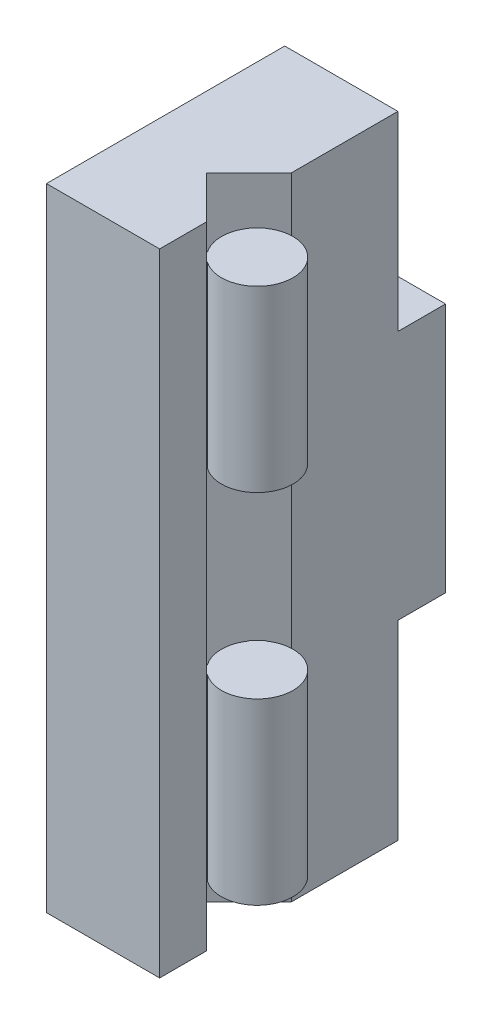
ISO-10303-21;
HEADER;
FILE_DESCRIPTION(('STEP AP214'),'2;1');
FILE_NAME('part.step','',(''),(''),'','','');
FILE_SCHEMA(('AUTOMOTIVE_DESIGN { 1 0 10303 214 1 1 1 1 }'));
ENDSEC;
DATA;
#1=APPLICATION_CONTEXT('core data for automotive mechanical design processes');
#2=APPLICATION_PROTOCOL_DEFINITION('international standard','automotive_design',2000,#1);
#3=PRODUCT_CONTEXT('',#1,'mechanical');
#4=PRODUCT('Part','Part','',(#3));
#5=PRODUCT_RELATED_PRODUCT_CATEGORY('part','',(#4));
#6=PRODUCT_DEFINITION_FORMATION('','',#4);
#7=PRODUCT_DEFINITION_CONTEXT('part definition',#1,'design');
#8=PRODUCT_DEFINITION('design','',#6,#7);
#9=PRODUCT_DEFINITION_SHAPE('','',#8);
#10=(LENGTH_UNIT() NAMED_UNIT(*) SI_UNIT(.MILLI.,.METRE.));
#11=(NAMED_UNIT(*) PLANE_ANGLE_UNIT() SI_UNIT($,.RADIAN.));
#12=(NAMED_UNIT(*) SI_UNIT($,.STERADIAN.) SOLID_ANGLE_UNIT());
#13=UNCERTAINTY_MEASURE_WITH_UNIT(LENGTH_MEASURE(1.E-05),#10,'distance_accuracy_value','');
#14=(GEOMETRIC_REPRESENTATION_CONTEXT(3) GLOBAL_UNCERTAINTY_ASSIGNED_CONTEXT((#13)) GLOBAL_UNIT_ASSIGNED_CONTEXT((#10,
#11,#12)) REPRESENTATION_CONTEXT('',''));
#15=CARTESIAN_POINT('',(0.,0.,0.));
#16=DIRECTION('',(0.,0.,1.));
#17=DIRECTION('',(1.,0.,0.));
#18=AXIS2_PLACEMENT_3D('',#15,#16,#17);
#19=CARTESIAN_POINT('',(18.7801622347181,-59.6376493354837,21.9806672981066));
#20=DIRECTION('',(0.707106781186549,0.,-0.707106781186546));
#21=DIRECTION('',(-0.707106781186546,0.,-0.70710678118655));
#22=AXIS2_PLACEMENT_3D('',#19,#20,#21);
#23=PLANE('',#22);
#24=DIRECTION('',(0.,-1.,0.));
#25=VECTOR('',#24,1.);
#26=CARTESIAN_POINT('',(16.8497474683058,53.,20.0502525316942));
#27=LINE('',#26,#25);
#28=CARTESIAN_POINT('',(16.8497474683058,-15.,20.0502525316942));
#29=VERTEX_POINT('',#28);
#30=CARTESIAN_POINT('',(16.8497474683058,-45.,20.0502525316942));
#31=VERTEX_POINT('',#30);
#32=EDGE_CURVE('E245',#29,#31,#27,.T.);
#33=ORIENTED_EDGE('',*,*,#32,.F.);
#34=DIRECTION('',(0.707106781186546,0.,0.70710678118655));
#35=VECTOR('',#34,1.);
#36=CARTESIAN_POINT('',(18.7801622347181,-15.,21.9806672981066));
#37=LINE('',#36,#35);
#38=CARTESIAN_POINT('',(16.9090880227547,-15.,20.1095930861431));
#39=VERTEX_POINT('',#38);
#40=EDGE_CURVE('E573',#29,#39,#37,.T.);
#41=ORIENTED_EDGE('',*,*,#40,.T.);
#42=DIRECTION('',(0.,-1.,0.));
#43=VECTOR('',#42,1.);
#44=CARTESIAN_POINT('',(16.9090880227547,45.,20.1095930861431));
#45=LINE('',#44,#43);
#46=CARTESIAN_POINT('',(16.9090880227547,-45.,20.1095930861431));
#47=VERTEX_POINT('',#46);
#48=EDGE_CURVE('E519',#39,#47,#45,.T.);
#49=ORIENTED_EDGE('',*,*,#48,.T.);
#50=DIRECTION('',(0.707106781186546,0.,0.70710678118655));
#51=VECTOR('',#50,1.);
#52=CARTESIAN_POINT('',(18.7801622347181,-45.,21.9806672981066));
#53=LINE('',#52,#51);
#54=EDGE_CURVE('E546',#31,#47,#53,.T.);
#55=ORIENTED_EDGE('',*,*,#54,.F.);
#56=EDGE_LOOP('',(#33,#41,#49,#55));
#57=FACE_BOUND('',#56,.T.);
#58=ADVANCED_FACE('F14',(#57),#23,.T.);
#59=CARTESIAN_POINT('',(17.365948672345,-59.6376493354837,23.3948808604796));
#60=DIRECTION('',(-0.707106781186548,0.,0.707106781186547));
#61=DIRECTION('',(0.707106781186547,0.,0.707106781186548));
#62=AXIS2_PLACEMENT_3D('',#59,#60,#61);
#63=PLANE('',#62);
#64=DIRECTION('',(0.,-1.,0.));
#65=VECTOR('',#64,1.);
#66=CARTESIAN_POINT('',(15.4948744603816,45.,21.5238066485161));
#67=LINE('',#66,#65);
#68=CARTESIAN_POINT('',(15.4948744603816,-45.,21.5238066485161));
#69=VERTEX_POINT('',#68);
#70=CARTESIAN_POINT('',(15.4948744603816,-15.,21.5238066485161));
#71=VERTEX_POINT('',#70);
#72=EDGE_CURVE('E516',#69,#71,#67,.F.);
#73=ORIENTED_EDGE('',*,*,#72,.T.);
#74=DIRECTION('',(-0.707106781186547,0.,-0.707106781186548));
#75=VECTOR('',#74,1.);
#76=CARTESIAN_POINT('',(17.365948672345,-15.,23.3948808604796));
#77=LINE('',#76,#75);
#78=CARTESIAN_POINT('',(15.4355339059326,-15.,21.4644660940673));
#79=VERTEX_POINT('',#78);
#80=EDGE_CURVE('E237',#71,#79,#77,.T.);
#81=ORIENTED_EDGE('',*,*,#80,.T.);
#82=DIRECTION('',(0.,1.,0.));
#83=VECTOR('',#82,1.);
#84=CARTESIAN_POINT('',(15.4355339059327,53.,21.4644660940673));
#85=LINE('',#84,#83);
#86=CARTESIAN_POINT('',(15.4355339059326,-45.,21.4644660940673));
#87=VERTEX_POINT('',#86);
#88=EDGE_CURVE('E249',#87,#79,#85,.T.);
#89=ORIENTED_EDGE('',*,*,#88,.F.);
#90=DIRECTION('',(-0.707106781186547,0.,-0.707106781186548));
#91=VECTOR('',#90,1.);
#92=CARTESIAN_POINT('',(17.365948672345,-45.,23.3948808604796));
#93=LINE('',#92,#91);
#94=EDGE_CURVE('E542',#69,#87,#93,.T.);
#95=ORIENTED_EDGE('',*,*,#94,.F.);
#96=EDGE_LOOP('',(#73,#81,#89,#95));
#97=FACE_BOUND('',#96,.T.);
#98=ADVANCED_FACE('F441',(#97),#63,.T.);
#99=CARTESIAN_POINT('',(17.365948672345,-59.6376493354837,26.6051191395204));
#100=DIRECTION('',(-0.707106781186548,0.,-0.707106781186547));
#101=DIRECTION('',(-0.707106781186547,0.,0.707106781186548));
#102=AXIS2_PLACEMENT_3D('',#99,#100,#101);
#103=PLANE('',#102);
#104=DIRECTION('',(0.,-1.,0.));
#105=VECTOR('',#104,1.);
#106=CARTESIAN_POINT('',(15.4355339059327,53.,28.5355339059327));
#107=LINE('',#106,#105);
#108=CARTESIAN_POINT('',(15.4355339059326,-15.,28.5355339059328));
#109=VERTEX_POINT('',#108);
#110=CARTESIAN_POINT('',(15.4355339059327,-45.,28.5355339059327));
#111=VERTEX_POINT('',#110);
#112=EDGE_CURVE('E524',#109,#111,#107,.T.);
#113=ORIENTED_EDGE('',*,*,#112,.F.);
#114=DIRECTION('',(0.707106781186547,0.,-0.707106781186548));
#115=VECTOR('',#114,1.);
#116=CARTESIAN_POINT('',(17.365948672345,-15.,26.6051191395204));
#117=LINE('',#116,#115);
#118=CARTESIAN_POINT('',(15.4948744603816,-15.,28.4761933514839));
#119=VERTEX_POINT('',#118);
#120=EDGE_CURVE('E571',#109,#119,#117,.T.);
#121=ORIENTED_EDGE('',*,*,#120,.T.);
#122=DIRECTION('',(0.,-1.,0.));
#123=VECTOR('',#122,1.);
#124=CARTESIAN_POINT('',(15.4948744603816,45.,28.4761933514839));
#125=LINE('',#124,#123);
#126=CARTESIAN_POINT('',(15.4948744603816,-45.,28.4761933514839));
#127=VERTEX_POINT('',#126);
#128=EDGE_CURVE('E513',#119,#127,#125,.T.);
#129=ORIENTED_EDGE('',*,*,#128,.T.);
#130=DIRECTION('',(0.707106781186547,0.,-0.707106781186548));
#131=VECTOR('',#130,1.);
#132=CARTESIAN_POINT('',(17.365948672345,-45.,26.6051191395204));
#133=LINE('',#132,#131);
#134=EDGE_CURVE('E539',#111,#127,#133,.T.);
#135=ORIENTED_EDGE('',*,*,#134,.F.);
#136=EDGE_LOOP('',(#113,#121,#129,#135));
#137=FACE_BOUND('',#136,.T.);
#138=ADVANCED_FACE('F447',(#137),#103,.T.);
#139=CARTESIAN_POINT('',(18.7801622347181,-59.6376493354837,28.0193327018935));
#140=DIRECTION('',(0.707106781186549,0.,0.707106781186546));
#141=DIRECTION('',(0.707106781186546,0.,-0.70710678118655));
#142=AXIS2_PLACEMENT_3D('',#139,#140,#141);
#143=PLANE('',#142);
#144=DIRECTION('',(0.,-1.,0.));
#145=VECTOR('',#144,1.);
#146=CARTESIAN_POINT('',(16.9090880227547,45.,29.8904069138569));
#147=LINE('',#146,#145);
#148=CARTESIAN_POINT('',(16.9090880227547,-45.,29.8904069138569));
#149=VERTEX_POINT('',#148);
#150=CARTESIAN_POINT('',(16.9090880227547,-15.,29.8904069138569));
#151=VERTEX_POINT('',#150);
#152=EDGE_CURVE('E22',#149,#151,#147,.F.);
#153=ORIENTED_EDGE('',*,*,#152,.T.);
#154=DIRECTION('',(-0.707106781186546,0.,0.70710678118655));
#155=VECTOR('',#154,1.);
#156=CARTESIAN_POINT('',(18.7801622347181,-15.,28.0193327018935));
#157=LINE('',#156,#155);
#158=CARTESIAN_POINT('',(16.8497474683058,-15.,29.9497474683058));
#159=VERTEX_POINT('',#158);
#160=EDGE_CURVE('E574',#151,#159,#157,.T.);
#161=ORIENTED_EDGE('',*,*,#160,.T.);
#162=DIRECTION('',(0.,1.,0.));
#163=VECTOR('',#162,1.);
#164=CARTESIAN_POINT('',(16.8497474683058,53.,29.9497474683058));
#165=LINE('',#164,#163);
#166=CARTESIAN_POINT('',(16.8497474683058,-45.,29.9497474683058));
#167=VERTEX_POINT('',#166);
#168=EDGE_CURVE('E522',#167,#159,#165,.T.);
#169=ORIENTED_EDGE('',*,*,#168,.F.);
#170=DIRECTION('',(-0.707106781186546,0.,0.70710678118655));
#171=VECTOR('',#170,1.);
#172=CARTESIAN_POINT('',(18.7801622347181,-45.,28.0193327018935));
#173=LINE('',#172,#171);
#174=EDGE_CURVE('E541',#149,#167,#173,.T.);
#175=ORIENTED_EDGE('',*,*,#174,.F.);
#176=EDGE_LOOP('',(#153,#161,#169,#175));
#177=FACE_BOUND('',#176,.T.);
#178=ADVANCED_FACE('F454',(#177),#143,.T.);
#179=DIRECTION('',(0.707106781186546,0.,0.70710678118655));
#180=VECTOR('',#179,1.);
#181=CARTESIAN_POINT('',(18.7801622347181,15.,21.9806672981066));
#182=LINE('',#181,#180);
#183=CARTESIAN_POINT('',(16.8497474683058,15.,20.0502525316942));
#184=VERTEX_POINT('',#183);
#185=CARTESIAN_POINT('',(16.9090880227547,15.,20.1095930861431));
#186=VERTEX_POINT('',#185);
#187=EDGE_CURVE('E221',#184,#186,#182,.T.);
#188=ORIENTED_EDGE('',*,*,#187,.F.);
#189=CARTESIAN_POINT('',(16.8497474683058,45.,20.0502525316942));
#190=VERTEX_POINT('',#189);
#191=EDGE_CURVE('E234',#190,#184,#27,.T.);
#192=ORIENTED_EDGE('',*,*,#191,.F.);
#193=DIRECTION('',(0.707106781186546,0.,0.70710678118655));
#194=VECTOR('',#193,1.);
#195=CARTESIAN_POINT('',(18.7801622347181,45.,21.9806672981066));
#196=LINE('',#195,#194);
#197=CARTESIAN_POINT('',(16.9090880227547,45.,20.1095930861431));
#198=VERTEX_POINT('',#197);
#199=EDGE_CURVE('E494',#190,#198,#196,.T.);
#200=ORIENTED_EDGE('',*,*,#199,.T.);
#201=DIRECTION('',(0.,-1.,0.));
#202=VECTOR('',#201,1.);
#203=CARTESIAN_POINT('',(16.9090880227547,45.,20.1095930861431));
#204=LINE('',#203,#202);
#205=EDGE_CURVE('E236',#198,#186,#204,.T.);
#206=ORIENTED_EDGE('',*,*,#205,.T.);
#207=EDGE_LOOP('',(#188,#192,#200,#206));
#208=FACE_BOUND('',#207,.T.);
#209=ADVANCED_FACE('F232',(#208),#23,.T.);
#210=DIRECTION('',(-0.707106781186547,0.,-0.707106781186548));
#211=VECTOR('',#210,1.);
#212=CARTESIAN_POINT('',(17.365948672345,15.,23.3948808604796));
#213=LINE('',#212,#211);
#214=CARTESIAN_POINT('',(15.4948744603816,15.,21.5238066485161));
#215=VERTEX_POINT('',#214);
#216=CARTESIAN_POINT('',(15.4355339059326,15.,21.4644660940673));
#217=VERTEX_POINT('',#216);
#218=EDGE_CURVE('E223',#215,#217,#213,.T.);
#219=ORIENTED_EDGE('',*,*,#218,.F.);
#220=DIRECTION('',(0.,-1.,0.));
#221=VECTOR('',#220,1.);
#222=CARTESIAN_POINT('',(15.4948744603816,45.,21.5238066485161));
#223=LINE('',#222,#221);
#224=CARTESIAN_POINT('',(15.4948744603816,45.,21.5238066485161));
#225=VERTEX_POINT('',#224);
#226=EDGE_CURVE('E501',#215,#225,#223,.F.);
#227=ORIENTED_EDGE('',*,*,#226,.T.);
#228=DIRECTION('',(-0.707106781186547,0.,-0.707106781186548));
#229=VECTOR('',#228,1.);
#230=CARTESIAN_POINT('',(17.365948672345,45.,23.3948808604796));
#231=LINE('',#230,#229);
#232=CARTESIAN_POINT('',(15.4355339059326,45.,21.4644660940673));
#233=VERTEX_POINT('',#232);
#234=EDGE_CURVE('E557',#225,#233,#231,.T.);
#235=ORIENTED_EDGE('',*,*,#234,.T.);
#236=EDGE_CURVE('E527',#217,#233,#85,.T.);
#237=ORIENTED_EDGE('',*,*,#236,.F.);
#238=EDGE_LOOP('',(#219,#227,#235,#237));
#239=FACE_BOUND('',#238,.T.);
#240=ADVANCED_FACE('F450',(#239),#63,.T.);
#241=DIRECTION('',(0.707106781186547,0.,-0.707106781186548));
#242=VECTOR('',#241,1.);
#243=CARTESIAN_POINT('',(17.365948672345,15.,26.6051191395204));
#244=LINE('',#243,#242);
#245=CARTESIAN_POINT('',(15.4355339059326,15.,28.5355339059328));
#246=VERTEX_POINT('',#245);
#247=CARTESIAN_POINT('',(15.4948744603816,15.,28.4761933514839));
#248=VERTEX_POINT('',#247);
#249=EDGE_CURVE('E238',#246,#248,#244,.T.);
#250=ORIENTED_EDGE('',*,*,#249,.F.);
#251=CARTESIAN_POINT('',(15.4355339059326,45.,28.5355339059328));
#252=VERTEX_POINT('',#251);
#253=EDGE_CURVE('E525',#252,#246,#107,.T.);
#254=ORIENTED_EDGE('',*,*,#253,.F.);
#255=DIRECTION('',(0.707106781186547,0.,-0.707106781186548));
#256=VECTOR('',#255,1.);
#257=CARTESIAN_POINT('',(17.365948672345,45.,26.6051191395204));
#258=LINE('',#257,#256);
#259=CARTESIAN_POINT('',(15.4948744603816,45.,28.4761933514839));
#260=VERTEX_POINT('',#259);
#261=EDGE_CURVE('E558',#252,#260,#258,.T.);
#262=ORIENTED_EDGE('',*,*,#261,.T.);
#263=DIRECTION('',(0.,-1.,0.));
#264=VECTOR('',#263,1.);
#265=CARTESIAN_POINT('',(15.4948744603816,45.,28.4761933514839));
#266=LINE('',#265,#264);
#267=EDGE_CURVE('E498',#260,#248,#266,.T.);
#268=ORIENTED_EDGE('',*,*,#267,.T.);
#269=EDGE_LOOP('',(#250,#254,#262,#268));
#270=FACE_BOUND('',#269,.T.);
#271=ADVANCED_FACE('F459',(#270),#103,.T.);
#272=DIRECTION('',(-0.707106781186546,0.,0.70710678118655));
#273=VECTOR('',#272,1.);
#274=CARTESIAN_POINT('',(18.7801622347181,15.,28.0193327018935));
#275=LINE('',#274,#273);
#276=CARTESIAN_POINT('',(16.9090880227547,15.,29.8904069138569));
#277=VERTEX_POINT('',#276);
#278=CARTESIAN_POINT('',(16.8497474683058,15.,29.9497474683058));
#279=VERTEX_POINT('',#278);
#280=EDGE_CURVE('E477',#277,#279,#275,.T.);
#281=ORIENTED_EDGE('',*,*,#280,.F.);
#282=DIRECTION('',(0.,-1.,0.));
#283=VECTOR('',#282,1.);
#284=CARTESIAN_POINT('',(16.9090880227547,45.,29.8904069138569));
#285=LINE('',#284,#283);
#286=CARTESIAN_POINT('',(16.9090880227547,45.,29.8904069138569));
#287=VERTEX_POINT('',#286);
#288=EDGE_CURVE('E9',#277,#287,#285,.F.);
#289=ORIENTED_EDGE('',*,*,#288,.T.);
#290=DIRECTION('',(-0.707106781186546,0.,0.70710678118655));
#291=VECTOR('',#290,1.);
#292=CARTESIAN_POINT('',(18.7801622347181,45.,28.0193327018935));
#293=LINE('',#292,#291);
#294=CARTESIAN_POINT('',(16.8497474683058,45.,29.9497474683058));
#295=VERTEX_POINT('',#294);
#296=EDGE_CURVE('E560',#287,#295,#293,.T.);
#297=ORIENTED_EDGE('',*,*,#296,.T.);
#298=EDGE_CURVE('E480',#279,#295,#165,.T.);
#299=ORIENTED_EDGE('',*,*,#298,.F.);
#300=EDGE_LOOP('',(#281,#289,#297,#299));
#301=FACE_BOUND('',#300,.T.);
#302=ADVANCED_FACE('F462',(#301),#143,.T.);
#303=CARTESIAN_POINT('',(-1.11022302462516E-13,53.,40.));
#304=DIRECTION('',(1.,0.,0.));
#305=DIRECTION('',(0.,0.,-1.));
#306=AXIS2_PLACEMENT_3D('',#303,#304,#305);
#307=PLANE('',#306);
#308=DIRECTION('',(0.,0.,-1.));
#309=VECTOR('',#308,1.);
#310=CARTESIAN_POINT('',(0.,30.,0.));
#311=LINE('',#310,#309);
#312=CARTESIAN_POINT('',(0.,30.,7.));
#313=VERTEX_POINT('',#312);
#314=CARTESIAN_POINT('',(-1.11022302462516E-13,30.,0.));
#315=VERTEX_POINT('',#314);
#316=EDGE_CURVE('E29',#313,#315,#311,.T.);
#317=ORIENTED_EDGE('',*,*,#316,.F.);
#318=DIRECTION('',(0.,1.,0.));
#319=VECTOR('',#318,1.);
#320=CARTESIAN_POINT('',(0.,30.,7.));
#321=LINE('',#320,#319);
#322=CARTESIAN_POINT('',(0.,-30.,7.));
#323=VERTEX_POINT('',#322);
#324=EDGE_CURVE('E247',#323,#313,#321,.T.);
#325=ORIENTED_EDGE('',*,*,#324,.F.);
#326=DIRECTION('',(0.,0.,1.));
#327=VECTOR('',#326,1.);
#328=CARTESIAN_POINT('',(0.,-30.,7.));
#329=LINE('',#328,#327);
#330=CARTESIAN_POINT('',(-1.11022302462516E-13,-30.,0.));
#331=VERTEX_POINT('',#330);
#332=EDGE_CURVE('E35',#331,#323,#329,.T.);
#333=ORIENTED_EDGE('',*,*,#332,.F.);
#334=DIRECTION('',(0.,-1.,0.));
#335=VECTOR('',#334,1.);
#336=CARTESIAN_POINT('',(-1.11022302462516E-13,53.,0.));
#337=LINE('',#336,#335);
#338=CARTESIAN_POINT('',(-1.11022302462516E-13,-53.,0.));
#339=VERTEX_POINT('',#338);
#340=EDGE_CURVE('E346',#331,#339,#337,.T.);
#341=ORIENTED_EDGE('',*,*,#340,.T.);
#342=DIRECTION('',(0.,0.,1.));
#343=VECTOR('',#342,1.);
#344=CARTESIAN_POINT('',(-1.11022302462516E-13,-53.,40.));
#345=LINE('',#344,#343);
#346=CARTESIAN_POINT('',(-1.11022302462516E-13,-53.,40.));
#347=VERTEX_POINT('',#346);
#348=EDGE_CURVE('E300',#339,#347,#345,.T.);
#349=ORIENTED_EDGE('',*,*,#348,.T.);
#350=DIRECTION('',(0.,-1.,0.));
#351=VECTOR('',#350,1.);
#352=CARTESIAN_POINT('',(-1.11022302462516E-13,53.,40.));
#353=LINE('',#352,#351);
#354=CARTESIAN_POINT('',(-1.11022302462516E-13,53.,40.));
#355=VERTEX_POINT('',#354);
#356=EDGE_CURVE('E343',#355,#347,#353,.T.);
#357=ORIENTED_EDGE('',*,*,#356,.F.);
#358=DIRECTION('',(0.,0.,1.));
#359=VECTOR('',#358,1.);
#360=CARTESIAN_POINT('',(-1.11022302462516E-13,53.,40.));
#361=LINE('',#360,#359);
#362=CARTESIAN_POINT('',(-1.11022302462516E-13,53.,0.));
#363=VERTEX_POINT('',#362);
#364=EDGE_CURVE('E319',#363,#355,#361,.T.);
#365=ORIENTED_EDGE('',*,*,#364,.F.);
#366=EDGE_CURVE('E348',#363,#315,#337,.T.);
#367=ORIENTED_EDGE('',*,*,#366,.T.);
#368=EDGE_LOOP('',(#317,#325,#333,#341,#349,#357,#365,#367));
#369=FACE_BOUND('',#368,.T.);
#370=ADVANCED_FACE('F362',(#369),#307,.F.);
#371=CARTESIAN_POINT('',(19.,53.,0.));
#372=DIRECTION('',(0.,0.,1.));
#373=DIRECTION('',(0.,1.,0.));
#374=AXIS2_PLACEMENT_3D('',#371,#372,#373);
#375=PLANE('',#374);
#376=DIRECTION('',(1.,0.,0.));
#377=VECTOR('',#376,1.);
#378=CARTESIAN_POINT('',(19.,21.,0.));
#379=LINE('',#378,#377);
#380=CARTESIAN_POINT('',(-6.,21.,0.));
#381=VERTEX_POINT('',#380);
#382=CARTESIAN_POINT('',(19.,21.,0.));
#383=VERTEX_POINT('',#382);
#384=EDGE_CURVE('E291',#381,#383,#379,.T.);
#385=ORIENTED_EDGE('',*,*,#384,.F.);
#386=DIRECTION('',(0.,-1.,0.));
#387=VECTOR('',#386,1.);
#388=CARTESIAN_POINT('',(-6.,30.,0.));
#389=LINE('',#388,#387);
#390=CARTESIAN_POINT('',(-6.,30.,0.));
#391=VERTEX_POINT('',#390);
#392=EDGE_CURVE('E255',#391,#381,#389,.T.);
#393=ORIENTED_EDGE('',*,*,#392,.F.);
#394=DIRECTION('',(1.,0.,0.));
#395=VECTOR('',#394,1.);
#396=CARTESIAN_POINT('',(-6.,30.,0.));
#397=LINE('',#396,#395);
#398=EDGE_CURVE('E275',#391,#315,#397,.T.);
#399=ORIENTED_EDGE('',*,*,#398,.T.);
#400=ORIENTED_EDGE('',*,*,#366,.F.);
#401=DIRECTION('',(-1.,0.,0.));
#402=VECTOR('',#401,1.);
#403=CARTESIAN_POINT('',(19.,53.,0.));
#404=LINE('',#403,#402);
#405=CARTESIAN_POINT('',(19.,53.,0.));
#406=VERTEX_POINT('',#405);
#407=EDGE_CURVE('E316',#406,#363,#404,.T.);
#408=ORIENTED_EDGE('',*,*,#407,.F.);
#409=DIRECTION('',(0.,-1.,0.));
#410=VECTOR('',#409,1.);
#411=CARTESIAN_POINT('',(19.,53.,0.));
#412=LINE('',#411,#410);
#413=EDGE_CURVE('E333',#406,#383,#412,.T.);
#414=ORIENTED_EDGE('',*,*,#413,.T.);
#415=EDGE_LOOP('',(#385,#393,#399,#400,#408,#414));
#416=FACE_BOUND('',#415,.T.);
#417=ADVANCED_FACE('F372',(#416),#375,.F.);
#418=ORIENTED_EDGE('',*,*,#340,.F.);
#419=DIRECTION('',(1.,0.,0.));
#420=VECTOR('',#419,1.);
#421=CARTESIAN_POINT('',(-6.,-30.,0.));
#422=LINE('',#421,#420);
#423=CARTESIAN_POINT('',(-6.,-30.,0.));
#424=VERTEX_POINT('',#423);
#425=EDGE_CURVE('E282',#424,#331,#422,.T.);
#426=ORIENTED_EDGE('',*,*,#425,.F.);
#427=DIRECTION('',(0.,-1.,0.));
#428=VECTOR('',#427,1.);
#429=CARTESIAN_POINT('',(-6.,-21.,0.));
#430=LINE('',#429,#428);
#431=CARTESIAN_POINT('',(-6.,-21.,0.));
#432=VERTEX_POINT('',#431);
#433=EDGE_CURVE('E267',#432,#424,#430,.T.);
#434=ORIENTED_EDGE('',*,*,#433,.F.);
#435=DIRECTION('',(1.,0.,0.));
#436=VECTOR('',#435,1.);
#437=CARTESIAN_POINT('',(19.,-21.,0.));
#438=LINE('',#437,#436);
#439=CARTESIAN_POINT('',(19.,-21.,0.));
#440=VERTEX_POINT('',#439);
#441=EDGE_CURVE('E285',#432,#440,#438,.T.);
#442=ORIENTED_EDGE('',*,*,#441,.T.);
#443=CARTESIAN_POINT('',(19.,-53.,0.));
#444=VERTEX_POINT('',#443);
#445=EDGE_CURVE('E331',#440,#444,#412,.T.);
#446=ORIENTED_EDGE('',*,*,#445,.T.);
#447=DIRECTION('',(-1.,0.,0.));
#448=VECTOR('',#447,1.);
#449=CARTESIAN_POINT('',(19.,-53.,0.));
#450=LINE('',#449,#448);
#451=EDGE_CURVE('E297',#444,#339,#450,.T.);
#452=ORIENTED_EDGE('',*,*,#451,.T.);
#453=EDGE_LOOP('',(#418,#426,#434,#442,#446,#452));
#454=FACE_BOUND('',#453,.T.);
#455=ADVANCED_FACE('F16',(#454),#375,.F.);
#456=CARTESIAN_POINT('',(-1.11022302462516E-13,53.,40.));
#457=DIRECTION('',(0.,0.,-1.));
#458=DIRECTION('',(0.,-1.,0.));
#459=AXIS2_PLACEMENT_3D('',#456,#457,#458);
#460=PLANE('',#459);
#461=DIRECTION('',(1.,0.,0.));
#462=VECTOR('',#461,1.);
#463=CARTESIAN_POINT('',(-1.11022302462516E-13,-53.,40.));
#464=LINE('',#463,#462);
#465=CARTESIAN_POINT('',(19.,-53.,40.));
#466=VERTEX_POINT('',#465);
#467=EDGE_CURVE('E302',#347,#466,#464,.T.);
#468=ORIENTED_EDGE('',*,*,#467,.T.);
#469=DIRECTION('',(0.,-1.,0.));
#470=VECTOR('',#469,1.);
#471=CARTESIAN_POINT('',(19.,53.,40.));
#472=LINE('',#471,#470);
#473=CARTESIAN_POINT('',(19.,53.,40.));
#474=VERTEX_POINT('',#473);
#475=EDGE_CURVE('E340',#474,#466,#472,.T.);
#476=ORIENTED_EDGE('',*,*,#475,.F.);
#477=DIRECTION('',(1.,0.,0.));
#478=VECTOR('',#477,1.);
#479=CARTESIAN_POINT('',(-1.11022302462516E-13,53.,40.));
#480=LINE('',#479,#478);
#481=EDGE_CURVE('E321',#355,#474,#480,.T.);
#482=ORIENTED_EDGE('',*,*,#481,.F.);
#483=ORIENTED_EDGE('',*,*,#356,.T.);
#484=EDGE_LOOP('',(#468,#476,#482,#483));
#485=FACE_BOUND('',#484,.T.);
#486=ADVANCED_FACE('F397',(#485),#460,.F.);
#487=CARTESIAN_POINT('',(19.,53.,32.1));
#488=DIRECTION('',(-1.,0.,0.));
#489=DIRECTION('',(0.,0.,1.));
#490=AXIS2_PLACEMENT_3D('',#487,#488,#489);
#491=PLANE('',#490);
#492=DIRECTION('',(0.,0.,-1.));
#493=VECTOR('',#492,1.);
#494=CARTESIAN_POINT('',(19.,-53.,32.1));
#495=LINE('',#494,#493);
#496=CARTESIAN_POINT('',(19.,-53.,32.1));
#497=VERTEX_POINT('',#496);
#498=EDGE_CURVE('E304',#466,#497,#495,.T.);
#499=ORIENTED_EDGE('',*,*,#498,.T.);
#500=DIRECTION('',(0.,-1.,0.));
#501=VECTOR('',#500,1.);
#502=CARTESIAN_POINT('',(19.,53.,32.1));
#503=LINE('',#502,#501);
#504=CARTESIAN_POINT('',(19.,53.,32.1));
#505=VERTEX_POINT('',#504);
#506=EDGE_CURVE('E338',#505,#497,#503,.T.);
#507=ORIENTED_EDGE('',*,*,#506,.F.);
#508=DIRECTION('',(0.,0.,-1.));
#509=VECTOR('',#508,1.);
#510=CARTESIAN_POINT('',(19.,53.,32.1));
#511=LINE('',#510,#509);
#512=EDGE_CURVE('E323',#474,#505,#511,.T.);
#513=ORIENTED_EDGE('',*,*,#512,.F.);
#514=ORIENTED_EDGE('',*,*,#475,.T.);
#515=EDGE_LOOP('',(#499,#507,#513,#514));
#516=FACE_BOUND('',#515,.T.);
#517=ADVANCED_FACE('F401',(#516),#491,.F.);
#518=CARTESIAN_POINT('',(19.,53.,32.1));
#519=DIRECTION('',(-0.707106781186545,0.,0.70710678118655));
#520=DIRECTION('',(0.70710678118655,0.,0.707106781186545));
#521=AXIS2_PLACEMENT_3D('',#518,#519,#520);
#522=PLANE('',#521);
#523=DIRECTION('',(0.707106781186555,0.,0.70710678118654));
#524=VECTOR('',#523,1.);
#525=CARTESIAN_POINT('',(19.,-15.,32.1));
#526=LINE('',#525,#524);
#527=EDGE_CURVE('E228',#109,#159,#526,.T.);
#528=ORIENTED_EDGE('',*,*,#527,.F.);
#529=ORIENTED_EDGE('',*,*,#112,.T.);
#530=DIRECTION('',(-0.707106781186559,0.,-0.707106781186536));
#531=VECTOR('',#530,1.);
#532=CARTESIAN_POINT('',(19.,-45.,32.1));
#533=LINE('',#532,#531);
#534=EDGE_CURVE('E533',#167,#111,#533,.T.);
#535=ORIENTED_EDGE('',*,*,#534,.F.);
#536=ORIENTED_EDGE('',*,*,#168,.T.);
#537=EDGE_LOOP('',(#528,#529,#535,#536));
#538=FACE_BOUND('',#537,.T.);
#539=ORIENTED_EDGE('',*,*,#253,.T.);
#540=DIRECTION('',(0.707106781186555,0.,0.70710678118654));
#541=VECTOR('',#540,1.);
#542=CARTESIAN_POINT('',(19.,15.,32.1));
#543=LINE('',#542,#541);
#544=EDGE_CURVE('E227',#246,#279,#543,.T.);
#545=ORIENTED_EDGE('',*,*,#544,.T.);
#546=ORIENTED_EDGE('',*,*,#298,.T.);
#547=DIRECTION('',(-0.707106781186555,0.,-0.707106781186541));
#548=VECTOR('',#547,1.);
#549=CARTESIAN_POINT('',(19.,45.,32.1));
#550=LINE('',#549,#548);
#551=EDGE_CURVE('E555',#295,#252,#550,.T.);
#552=ORIENTED_EDGE('',*,*,#551,.T.);
#553=EDGE_LOOP('',(#539,#545,#546,#552));
#554=FACE_BOUND('',#553,.T.);
#555=ORIENTED_EDGE('',*,*,#506,.T.);
#556=DIRECTION('',(-0.70710678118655,0.,-0.707106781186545));
#557=VECTOR('',#556,1.);
#558=CARTESIAN_POINT('',(19.,-53.,32.1));
#559=LINE('',#558,#557);
#560=CARTESIAN_POINT('',(11.8999999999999,-53.,25.));
#561=VERTEX_POINT('',#560);
#562=EDGE_CURVE('E307',#497,#561,#559,.T.);
#563=ORIENTED_EDGE('',*,*,#562,.T.);
#564=DIRECTION('',(0.,-1.,0.));
#565=VECTOR('',#564,1.);
#566=CARTESIAN_POINT('',(11.8999999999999,53.,25.));
#567=LINE('',#566,#565);
#568=CARTESIAN_POINT('',(11.8999999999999,53.,25.));
#569=VERTEX_POINT('',#568);
#570=EDGE_CURVE('E336',#569,#561,#567,.T.);
#571=ORIENTED_EDGE('',*,*,#570,.F.);
#572=DIRECTION('',(-0.70710678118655,0.,-0.707106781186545));
#573=VECTOR('',#572,1.);
#574=CARTESIAN_POINT('',(19.,53.,32.1));
#575=LINE('',#574,#573);
#576=EDGE_CURVE('E325',#505,#569,#575,.T.);
#577=ORIENTED_EDGE('',*,*,#576,.F.);
#578=EDGE_LOOP('',(#555,#563,#571,#577));
#579=FACE_BOUND('',#578,.T.);
#580=ADVANCED_FACE('F426',(#538,#554,#579),#522,.F.);
#581=CARTESIAN_POINT('',(19.,53.,17.9));
#582=DIRECTION('',(-0.707106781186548,0.,-0.707106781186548));
#583=DIRECTION('',(-0.707106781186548,0.,0.707106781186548));
#584=AXIS2_PLACEMENT_3D('',#581,#582,#583);
#585=PLANE('',#584);
#586=DIRECTION('',(-0.707106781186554,0.,0.707106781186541));
#587=VECTOR('',#586,1.);
#588=CARTESIAN_POINT('',(11.8999999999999,-15.,25.));
#589=LINE('',#588,#587);
#590=EDGE_CURVE('E590',#29,#79,#589,.T.);
#591=ORIENTED_EDGE('',*,*,#590,.F.);
#592=ORIENTED_EDGE('',*,*,#32,.T.);
#593=DIRECTION('',(0.707106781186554,0.,-0.707106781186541));
#594=VECTOR('',#593,1.);
#595=CARTESIAN_POINT('',(11.8999999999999,-45.,25.));
#596=LINE('',#595,#594);
#597=EDGE_CURVE('E543',#87,#31,#596,.T.);
#598=ORIENTED_EDGE('',*,*,#597,.F.);
#599=ORIENTED_EDGE('',*,*,#88,.T.);
#600=EDGE_LOOP('',(#591,#592,#598,#599));
#601=FACE_BOUND('',#600,.T.);
#602=ORIENTED_EDGE('',*,*,#191,.T.);
#603=DIRECTION('',(-0.707106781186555,0.,0.707106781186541));
#604=VECTOR('',#603,1.);
#605=CARTESIAN_POINT('',(11.8999999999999,15.,25.));
#606=LINE('',#605,#604);
#607=EDGE_CURVE('E216',#184,#217,#606,.T.);
#608=ORIENTED_EDGE('',*,*,#607,.T.);
#609=ORIENTED_EDGE('',*,*,#236,.T.);
#610=DIRECTION('',(0.707106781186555,0.,-0.707106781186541));
#611=VECTOR('',#610,1.);
#612=CARTESIAN_POINT('',(11.8999999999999,45.,25.));
#613=LINE('',#612,#611);
#614=EDGE_CURVE('E244',#233,#190,#613,.T.);
#615=ORIENTED_EDGE('',*,*,#614,.T.);
#616=EDGE_LOOP('',(#602,#608,#609,#615));
#617=FACE_BOUND('',#616,.T.);
#618=ORIENTED_EDGE('',*,*,#570,.T.);
#619=DIRECTION('',(0.707106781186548,0.,-0.707106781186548));
#620=VECTOR('',#619,1.);
#621=CARTESIAN_POINT('',(19.,-53.,17.9));
#622=LINE('',#621,#620);
#623=CARTESIAN_POINT('',(19.,-53.,17.9));
#624=VERTEX_POINT('',#623);
#625=EDGE_CURVE('E310',#561,#624,#622,.T.);
#626=ORIENTED_EDGE('',*,*,#625,.T.);
#627=DIRECTION('',(0.,-1.,0.));
#628=VECTOR('',#627,1.);
#629=CARTESIAN_POINT('',(19.,53.,17.9));
#630=LINE('',#629,#628);
#631=CARTESIAN_POINT('',(19.,53.,17.9));
#632=VERTEX_POINT('',#631);
#633=EDGE_CURVE('E334',#632,#624,#630,.T.);
#634=ORIENTED_EDGE('',*,*,#633,.F.);
#635=DIRECTION('',(0.707106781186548,0.,-0.707106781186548));
#636=VECTOR('',#635,1.);
#637=CARTESIAN_POINT('',(19.,53.,17.9));
#638=LINE('',#637,#636);
#639=EDGE_CURVE('E327',#569,#632,#638,.T.);
#640=ORIENTED_EDGE('',*,*,#639,.F.);
#641=EDGE_LOOP('',(#618,#626,#634,#640));
#642=FACE_BOUND('',#641,.T.);
#643=ADVANCED_FACE('F241',(#601,#617,#642),#585,.F.);
#644=CARTESIAN_POINT('',(19.,53.,17.9));
#645=DIRECTION('',(-1.,0.,0.));
#646=DIRECTION('',(0.,-1.,0.));
#647=AXIS2_PLACEMENT_3D('',#644,#645,#646);
#648=PLANE('',#647);
#649=DIRECTION('',(0.,0.,-1.));
#650=VECTOR('',#649,1.);
#651=CARTESIAN_POINT('',(19.,-53.,17.9));
#652=LINE('',#651,#650);
#653=EDGE_CURVE('E313',#624,#444,#652,.T.);
#654=ORIENTED_EDGE('',*,*,#653,.T.);
#655=ORIENTED_EDGE('',*,*,#445,.F.);
#656=DIRECTION('',(0.,0.,-1.));
#657=VECTOR('',#656,1.);
#658=CARTESIAN_POINT('',(19.,-21.,0.));
#659=LINE('',#658,#657);
#660=CARTESIAN_POINT('',(19.,-21.,-8.));
#661=VERTEX_POINT('',#660);
#662=EDGE_CURVE('E286',#440,#661,#659,.T.);
#663=ORIENTED_EDGE('',*,*,#662,.T.);
#664=DIRECTION('',(0.,-1.,0.));
#665=VECTOR('',#664,1.);
#666=CARTESIAN_POINT('',(19.,21.,-8.));
#667=LINE('',#666,#665);
#668=CARTESIAN_POINT('',(19.,21.,-8.));
#669=VERTEX_POINT('',#668);
#670=EDGE_CURVE('E294',#669,#661,#667,.T.);
#671=ORIENTED_EDGE('',*,*,#670,.F.);
#672=DIRECTION('',(0.,0.,-1.));
#673=VECTOR('',#672,1.);
#674=CARTESIAN_POINT('',(19.,21.,0.));
#675=LINE('',#674,#673);
#676=EDGE_CURVE('E288',#383,#669,#675,.T.);
#677=ORIENTED_EDGE('',*,*,#676,.F.);
#678=ORIENTED_EDGE('',*,*,#413,.F.);
#679=DIRECTION('',(0.,0.,-1.));
#680=VECTOR('',#679,1.);
#681=CARTESIAN_POINT('',(19.,53.,17.9));
#682=LINE('',#681,#680);
#683=EDGE_CURVE('E329',#632,#406,#682,.T.);
#684=ORIENTED_EDGE('',*,*,#683,.F.);
#685=ORIENTED_EDGE('',*,*,#633,.T.);
#686=EDGE_LOOP('',(#654,#655,#663,#671,#677,#678,#684,#685));
#687=FACE_BOUND('',#686,.T.);
#688=ADVANCED_FACE('F414',(#687),#648,.F.);
#689=CARTESIAN_POINT('',(19.,53.,0.));
#690=DIRECTION('',(0.,-1.,0.));
#691=DIRECTION('',(1.,0.,0.));
#692=AXIS2_PLACEMENT_3D('',#689,#690,#691);
#693=PLANE('',#692);
#694=ORIENTED_EDGE('',*,*,#576,.T.);
#695=ORIENTED_EDGE('',*,*,#639,.T.);
#696=ORIENTED_EDGE('',*,*,#683,.T.);
#697=ORIENTED_EDGE('',*,*,#407,.T.);
#698=ORIENTED_EDGE('',*,*,#364,.T.);
#699=ORIENTED_EDGE('',*,*,#481,.T.);
#700=ORIENTED_EDGE('',*,*,#512,.T.);
#701=EDGE_LOOP('',(#694,#695,#696,#697,#698,#699,#700));
#702=FACE_BOUND('',#701,.T.);
#703=ADVANCED_FACE('F405',(#702),#693,.F.);
#704=CARTESIAN_POINT('',(19.,-53.,0.));
#705=DIRECTION('',(0.,-1.,0.));
#706=DIRECTION('',(1.,0.,0.));
#707=AXIS2_PLACEMENT_3D('',#704,#705,#706);
#708=PLANE('',#707);
#709=ORIENTED_EDGE('',*,*,#653,.F.);
#710=ORIENTED_EDGE('',*,*,#625,.F.);
#711=ORIENTED_EDGE('',*,*,#562,.F.);
#712=ORIENTED_EDGE('',*,*,#498,.F.);
#713=ORIENTED_EDGE('',*,*,#467,.F.);
#714=ORIENTED_EDGE('',*,*,#348,.F.);
#715=ORIENTED_EDGE('',*,*,#451,.F.);
#716=EDGE_LOOP('',(#709,#710,#711,#712,#713,#714,#715));
#717=FACE_BOUND('',#716,.T.);
#718=ADVANCED_FACE('F392',(#717),#708,.T.);
#719=CARTESIAN_POINT('',(0.,21.,-8.));
#720=DIRECTION('',(0.,0.,1.));
#721=DIRECTION('',(1.,0.,0.));
#722=AXIS2_PLACEMENT_3D('',#719,#720,#721);
#723=PLANE('',#722);
#724=DIRECTION('',(-1.,0.,0.));
#725=VECTOR('',#724,1.);
#726=CARTESIAN_POINT('',(0.,-21.,-8.));
#727=LINE('',#726,#725);
#728=CARTESIAN_POINT('',(-6.,-21.,-8.));
#729=VERTEX_POINT('',#728);
#730=EDGE_CURVE('E283',#661,#729,#727,.T.);
#731=ORIENTED_EDGE('',*,*,#730,.T.);
#732=DIRECTION('',(0.,-1.,0.));
#733=VECTOR('',#732,1.);
#734=CARTESIAN_POINT('',(-6.,21.,-8.));
#735=LINE('',#734,#733);
#736=CARTESIAN_POINT('',(-6.,21.,-8.));
#737=VERTEX_POINT('',#736);
#738=EDGE_CURVE('E261',#737,#729,#735,.T.);
#739=ORIENTED_EDGE('',*,*,#738,.F.);
#740=DIRECTION('',(-1.,0.,0.));
#741=VECTOR('',#740,1.);
#742=CARTESIAN_POINT('',(0.,21.,-8.));
#743=LINE('',#742,#741);
#744=EDGE_CURVE('E289',#669,#737,#743,.T.);
#745=ORIENTED_EDGE('',*,*,#744,.F.);
#746=ORIENTED_EDGE('',*,*,#670,.T.);
#747=EDGE_LOOP('',(#731,#739,#745,#746));
#748=FACE_BOUND('',#747,.T.);
#749=ADVANCED_FACE('F418',(#748),#723,.F.);
#750=CARTESIAN_POINT('',(19.,21.,0.));
#751=DIRECTION('',(0.,1.,0.));
#752=DIRECTION('',(-1.,0.,0.));
#753=AXIS2_PLACEMENT_3D('',#750,#751,#752);
#754=PLANE('',#753);
#755=ORIENTED_EDGE('',*,*,#676,.T.);
#756=ORIENTED_EDGE('',*,*,#744,.T.);
#757=DIRECTION('',(0.,0.,-1.));
#758=VECTOR('',#757,1.);
#759=CARTESIAN_POINT('',(-6.,21.,0.));
#760=LINE('',#759,#758);
#761=EDGE_CURVE('E258',#381,#737,#760,.T.);
#762=ORIENTED_EDGE('',*,*,#761,.F.);
#763=ORIENTED_EDGE('',*,*,#384,.T.);
#764=EDGE_LOOP('',(#755,#756,#762,#763));
#765=FACE_BOUND('',#764,.T.);
#766=ADVANCED_FACE('F412',(#765),#754,.T.);
#767=CARTESIAN_POINT('',(19.,-21.,0.));
#768=DIRECTION('',(0.,1.,0.));
#769=DIRECTION('',(-1.,0.,0.));
#770=AXIS2_PLACEMENT_3D('',#767,#768,#769);
#771=PLANE('',#770);
#772=ORIENTED_EDGE('',*,*,#662,.F.);
#773=ORIENTED_EDGE('',*,*,#441,.F.);
#774=DIRECTION('',(0.,0.,1.));
#775=VECTOR('',#774,1.);
#776=CARTESIAN_POINT('',(-6.,-21.,-8.));
#777=LINE('',#776,#775);
#778=EDGE_CURVE('E264',#729,#432,#777,.T.);
#779=ORIENTED_EDGE('',*,*,#778,.F.);
#780=ORIENTED_EDGE('',*,*,#730,.F.);
#781=EDGE_LOOP('',(#772,#773,#779,#780));
#782=FACE_BOUND('',#781,.T.);
#783=ADVANCED_FACE('F421',(#782),#771,.F.);
#784=CARTESIAN_POINT('',(-6.,-30.,7.));
#785=DIRECTION('',(0.,1.,0.));
#786=DIRECTION('',(-1.,0.,0.));
#787=AXIS2_PLACEMENT_3D('',#784,#785,#786);
#788=PLANE('',#787);
#789=ORIENTED_EDGE('',*,*,#332,.T.);
#790=DIRECTION('',(1.,0.,0.));
#791=VECTOR('',#790,1.);
#792=CARTESIAN_POINT('',(-6.,-30.,7.));
#793=LINE('',#792,#791);
#794=CARTESIAN_POINT('',(-6.,-30.,7.));
#795=VERTEX_POINT('',#794);
#796=EDGE_CURVE('E279',#795,#323,#793,.T.);
#797=ORIENTED_EDGE('',*,*,#796,.F.);
#798=DIRECTION('',(0.,0.,1.));
#799=VECTOR('',#798,1.);
#800=CARTESIAN_POINT('',(-6.,-30.,7.));
#801=LINE('',#800,#799);
#802=EDGE_CURVE('E269',#424,#795,#801,.T.);
#803=ORIENTED_EDGE('',*,*,#802,.F.);
#804=ORIENTED_EDGE('',*,*,#425,.T.);
#805=EDGE_LOOP('',(#789,#797,#803,#804));
#806=FACE_BOUND('',#805,.T.);
#807=ADVANCED_FACE('F383',(#806),#788,.F.);
#808=CARTESIAN_POINT('',(-6.,30.,7.));
#809=DIRECTION('',(0.,0.,-1.));
#810=DIRECTION('',(-1.,0.,0.));
#811=AXIS2_PLACEMENT_3D('',#808,#809,#810);
#812=PLANE('',#811);
#813=ORIENTED_EDGE('',*,*,#324,.T.);
#814=DIRECTION('',(1.,0.,0.));
#815=VECTOR('',#814,1.);
#816=CARTESIAN_POINT('',(-6.,30.,7.));
#817=LINE('',#816,#815);
#818=CARTESIAN_POINT('',(-6.,30.,7.));
#819=VERTEX_POINT('',#818);
#820=EDGE_CURVE('E276',#819,#313,#817,.T.);
#821=ORIENTED_EDGE('',*,*,#820,.F.);
#822=DIRECTION('',(0.,1.,0.));
#823=VECTOR('',#822,1.);
#824=CARTESIAN_POINT('',(-6.,30.,7.));
#825=LINE('',#824,#823);
#826=EDGE_CURVE('E271',#795,#819,#825,.T.);
#827=ORIENTED_EDGE('',*,*,#826,.F.);
#828=ORIENTED_EDGE('',*,*,#796,.T.);
#829=EDGE_LOOP('',(#813,#821,#827,#828));
#830=FACE_BOUND('',#829,.T.);
#831=ADVANCED_FACE('F381',(#830),#812,.F.);
#832=CARTESIAN_POINT('',(-6.,30.,0.));
#833=DIRECTION('',(0.,-1.,0.));
#834=DIRECTION('',(1.,0.,0.));
#835=AXIS2_PLACEMENT_3D('',#832,#833,#834);
#836=PLANE('',#835);
#837=ORIENTED_EDGE('',*,*,#316,.T.);
#838=ORIENTED_EDGE('',*,*,#398,.F.);
#839=DIRECTION('',(0.,0.,-1.));
#840=VECTOR('',#839,1.);
#841=CARTESIAN_POINT('',(-6.,30.,0.));
#842=LINE('',#841,#840);
#843=EDGE_CURVE('E273',#819,#391,#842,.T.);
#844=ORIENTED_EDGE('',*,*,#843,.F.);
#845=ORIENTED_EDGE('',*,*,#820,.T.);
#846=EDGE_LOOP('',(#837,#838,#844,#845));
#847=FACE_BOUND('',#846,.T.);
#848=ADVANCED_FACE('F368',(#847),#836,.F.);
#849=CARTESIAN_POINT('',(-6.,-30.,0.));
#850=DIRECTION('',(1.,0.,0.));
#851=DIRECTION('',(0.,0.,-1.));
#852=AXIS2_PLACEMENT_3D('',#849,#850,#851);
#853=PLANE('',#852);
#854=ORIENTED_EDGE('',*,*,#392,.T.);
#855=ORIENTED_EDGE('',*,*,#761,.T.);
#856=ORIENTED_EDGE('',*,*,#738,.T.);
#857=ORIENTED_EDGE('',*,*,#778,.T.);
#858=ORIENTED_EDGE('',*,*,#433,.T.);
#859=ORIENTED_EDGE('',*,*,#802,.T.);
#860=ORIENTED_EDGE('',*,*,#826,.T.);
#861=ORIENTED_EDGE('',*,*,#843,.T.);
#862=EDGE_LOOP('',(#854,#855,#856,#857,#858,#859,#860,#861));
#863=FACE_BOUND('',#862,.T.);
#864=ADVANCED_FACE('F375',(#863),#853,.F.);
#865=CARTESIAN_POINT('',(20.3852813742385,45.,25.));
#866=DIRECTION('',(0.,-1.,0.));
#867=DIRECTION('',(1.,0.,0.));
#868=AXIS2_PLACEMENT_3D('',#865,#866,#867);
#869=CYLINDRICAL_SURFACE('',#868,6.);
#870=ORIENTED_EDGE('',*,*,#48,.F.);
#871=CARTESIAN_POINT('',(20.3852813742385,-15.,25.));
#872=DIRECTION('',(0.,1.,0.));
#873=DIRECTION('',(-1.,0.,0.));
#874=AXIS2_PLACEMENT_3D('',#871,#872,#873);
#875=CIRCLE('',#874,6.);
#876=EDGE_CURVE('E512',#151,#39,#875,.T.);
#877=ORIENTED_EDGE('',*,*,#876,.F.);
#878=ORIENTED_EDGE('',*,*,#152,.F.);
#879=CARTESIAN_POINT('',(20.3852813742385,-45.,25.));
#880=DIRECTION('',(0.,1.,0.));
#881=DIRECTION('',(-1.,0.,0.));
#882=AXIS2_PLACEMENT_3D('',#879,#880,#881);
#883=CIRCLE('',#882,6.);
#884=EDGE_CURVE('E508',#149,#47,#883,.T.);
#885=ORIENTED_EDGE('',*,*,#884,.T.);
#886=EDGE_LOOP('',(#870,#877,#878,#885));
#887=FACE_BOUND('',#886,.T.);
#888=ADVANCED_FACE('F586',(#887),#869,.T.);
#889=ORIENTED_EDGE('',*,*,#72,.F.);
#890=EDGE_CURVE('E505',#69,#127,#883,.T.);
#891=ORIENTED_EDGE('',*,*,#890,.T.);
#892=ORIENTED_EDGE('',*,*,#128,.F.);
#893=EDGE_CURVE('E509',#71,#119,#875,.T.);
#894=ORIENTED_EDGE('',*,*,#893,.F.);
#895=EDGE_LOOP('',(#889,#891,#892,#894));
#896=FACE_BOUND('',#895,.T.);
#897=ADVANCED_FACE('F596',(#896),#869,.T.);
#898=CARTESIAN_POINT('',(20.3852813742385,-45.,25.));
#899=DIRECTION('',(0.,1.,0.));
#900=DIRECTION('',(-1.,0.,0.));
#901=AXIS2_PLACEMENT_3D('',#898,#899,#900);
#902=PLANE('',#901);
#903=ORIENTED_EDGE('',*,*,#890,.F.);
#904=ORIENTED_EDGE('',*,*,#94,.T.);
#905=ORIENTED_EDGE('',*,*,#597,.T.);
#906=ORIENTED_EDGE('',*,*,#54,.T.);
#907=ORIENTED_EDGE('',*,*,#884,.F.);
#908=ORIENTED_EDGE('',*,*,#174,.T.);
#909=ORIENTED_EDGE('',*,*,#534,.T.);
#910=ORIENTED_EDGE('',*,*,#134,.T.);
#911=EDGE_LOOP('',(#903,#904,#905,#906,#907,#908,#909,#910));
#912=FACE_BOUND('',#911,.T.);
#913=ADVANCED_FACE('F538',(#912),#902,.F.);
#914=CARTESIAN_POINT('',(20.3852813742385,-15.,25.));
#915=DIRECTION('',(0.,1.,0.));
#916=DIRECTION('',(-1.,0.,0.));
#917=AXIS2_PLACEMENT_3D('',#914,#915,#916);
#918=PLANE('',#917);
#919=ORIENTED_EDGE('',*,*,#80,.F.);
#920=ORIENTED_EDGE('',*,*,#893,.T.);
#921=ORIENTED_EDGE('',*,*,#120,.F.);
#922=ORIENTED_EDGE('',*,*,#527,.T.);
#923=ORIENTED_EDGE('',*,*,#160,.F.);
#924=ORIENTED_EDGE('',*,*,#876,.T.);
#925=ORIENTED_EDGE('',*,*,#40,.F.);
#926=ORIENTED_EDGE('',*,*,#590,.T.);
#927=EDGE_LOOP('',(#919,#920,#921,#922,#923,#924,#925,#926));
#928=FACE_BOUND('',#927,.T.);
#929=ADVANCED_FACE('F588',(#928),#918,.T.);
#930=CARTESIAN_POINT('',(20.3852813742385,45.,25.));
#931=DIRECTION('',(0.,-1.,0.));
#932=DIRECTION('',(1.,0.,0.));
#933=AXIS2_PLACEMENT_3D('',#930,#931,#932);
#934=CYLINDRICAL_SURFACE('',#933,6.);
#935=ORIENTED_EDGE('',*,*,#205,.F.);
#936=CARTESIAN_POINT('',(20.3852813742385,45.,25.));
#937=DIRECTION('',(0.,1.,0.));
#938=DIRECTION('',(-1.,0.,0.));
#939=AXIS2_PLACEMENT_3D('',#936,#937,#938);
#940=CIRCLE('',#939,6.);
#941=EDGE_CURVE('E487',#287,#198,#940,.T.);
#942=ORIENTED_EDGE('',*,*,#941,.F.);
#943=ORIENTED_EDGE('',*,*,#288,.F.);
#944=CARTESIAN_POINT('',(20.3852813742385,15.,25.));
#945=DIRECTION('',(0.,1.,0.));
#946=DIRECTION('',(-1.,0.,0.));
#947=AXIS2_PLACEMENT_3D('',#944,#945,#946);
#948=CIRCLE('',#947,6.);
#949=EDGE_CURVE('E486',#277,#186,#948,.T.);
#950=ORIENTED_EDGE('',*,*,#949,.T.);
#951=EDGE_LOOP('',(#935,#942,#943,#950));
#952=FACE_BOUND('',#951,.T.);
#953=ADVANCED_FACE('F485',(#952),#934,.T.);
#954=CARTESIAN_POINT('',(20.3852813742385,45.,25.));
#955=DIRECTION('',(0.,1.,0.));
#956=DIRECTION('',(-1.,0.,0.));
#957=AXIS2_PLACEMENT_3D('',#954,#955,#956);
#958=PLANE('',#957);
#959=ORIENTED_EDGE('',*,*,#234,.F.);
#960=EDGE_CURVE('E488',#225,#260,#940,.T.);
#961=ORIENTED_EDGE('',*,*,#960,.T.);
#962=ORIENTED_EDGE('',*,*,#261,.F.);
#963=ORIENTED_EDGE('',*,*,#551,.F.);
#964=ORIENTED_EDGE('',*,*,#296,.F.);
#965=ORIENTED_EDGE('',*,*,#941,.T.);
#966=ORIENTED_EDGE('',*,*,#199,.F.);
#967=ORIENTED_EDGE('',*,*,#614,.F.);
#968=EDGE_LOOP('',(#959,#961,#962,#963,#964,#965,#966,#967));
#969=FACE_BOUND('',#968,.T.);
#970=ADVANCED_FACE('F564',(#969),#958,.T.);
#971=ORIENTED_EDGE('',*,*,#226,.F.);
#972=EDGE_CURVE('E489',#215,#248,#948,.T.);
#973=ORIENTED_EDGE('',*,*,#972,.T.);
#974=ORIENTED_EDGE('',*,*,#267,.F.);
#975=ORIENTED_EDGE('',*,*,#960,.F.);
#976=EDGE_LOOP('',(#971,#973,#974,#975));
#977=FACE_BOUND('',#976,.T.);
#978=ADVANCED_FACE('F606',(#977),#934,.T.);
#979=CARTESIAN_POINT('',(20.3852813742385,15.,25.));
#980=DIRECTION('',(0.,1.,0.));
#981=DIRECTION('',(-1.,0.,0.));
#982=AXIS2_PLACEMENT_3D('',#979,#980,#981);
#983=PLANE('',#982);
#984=ORIENTED_EDGE('',*,*,#972,.F.);
#985=ORIENTED_EDGE('',*,*,#218,.T.);
#986=ORIENTED_EDGE('',*,*,#607,.F.);
#987=ORIENTED_EDGE('',*,*,#187,.T.);
#988=ORIENTED_EDGE('',*,*,#949,.F.);
#989=ORIENTED_EDGE('',*,*,#280,.T.);
#990=ORIENTED_EDGE('',*,*,#544,.F.);
#991=ORIENTED_EDGE('',*,*,#249,.T.);
#992=EDGE_LOOP('',(#984,#985,#986,#987,#988,#989,#990,#991));
#993=FACE_BOUND('',#992,.T.);
#994=ADVANCED_FACE('F219',(#993),#983,.F.);
#995=CLOSED_SHELL('',(#58,#98,#138,#178,#209,#240,#271,#302,#370,#417,#455,#486,#517,#580,#643,
#688,#703,#718,#749,#766,#783,#807,#831,#848,#864,#888,#897,#913,#929,#953,#970,#978,#994));
#996=MANIFOLD_SOLID_BREP('B1',#995);
#997=ADVANCED_BREP_SHAPE_REPRESENTATION('',(#18,#996),#14);
#998=SHAPE_DEFINITION_REPRESENTATION(#9,#997);
ENDSEC;
END-ISO-10303-21;
